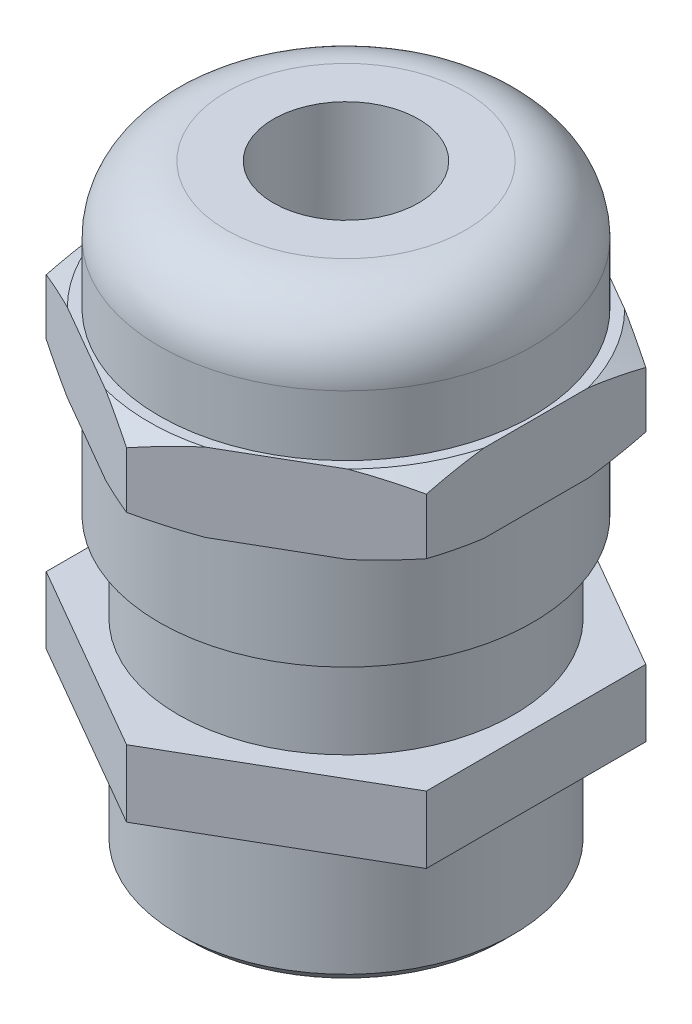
from build123d import *

# Parameters (mm, degrees)
ESTRUSIONE1_DEPTH        = 3
SCHIZZO14_R              = 7.5
ESTRUSIONE2_DEPTH        = 4
ESTRUSIONE3_START        = -4.5
SCHIZZO15_R              = 7.5
ESTRUSIONE3_DEPTH        = 4.5
SCHIZZO21_R              = 8.35
ESTRUSIONE5_DEPTH        = 4.5
ESTRUSIONE4_DEPTH        = 3.5
SCHIZZO17_W              = 8.35
SCHIZZO17_H              = 5.7
SCHIZZO18_W              = 7.5
SCHIZZO18_H              = 6
FORO4_D                  = 6.5
SMUSSO4_SIZE             = 0.5
RACCORDO4_R              = 3
SCHIZZO23_R              = 4.25
TAGLIO_ESTRUSIONE1_DEPTH = 20


with BuildPart() as part:
    # Schizzo13 → Estrusione1 (new body)
    with BuildSketch(Plane(origin=(0, 3, 0), x_dir=(-1, 0, 0), z_dir=(0, 1, 0))):
        Polygon((0, -9.814954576), (8.5, -4.907477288), (8.5, 4.907477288), (0, 9.814954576), (-8.5, 4.907477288), (-8.5, -4.907477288), align=None)
    extrude(amount=-ESTRUSIONE1_DEPTH)

    # Schizzo14 → Estrusione2 (add)
    with BuildSketch(Plane(origin=(0, 3, 0), x_dir=(-1, 0, 0), z_dir=(0, 1, 0))):
        with Locations(Location((0, 0, 0), (0, 0, 270))):
            Circle(SCHIZZO14_R)
    extrude(amount=ESTRUSIONE2_DEPTH)

    # Schizzo15 → Estrusione3 (add)
    with BuildSketch(Plane(origin=(0, 7, 0), x_dir=(-1, 0, 0), z_dir=(0, 1, 0)).offset(ESTRUSIONE3_START)):
        with Locations(Location((0, 0, 0), (0, 0, 270))):
            Circle(SCHIZZO15_R)
    extrude(amount=ESTRUSIONE3_DEPTH)

    # Schizzo21 → Estrusione5 (add)
    with BuildSketch(Plane(origin=(0, 7, 0), x_dir=(-1, 0, 0), z_dir=(0, 1, 0))):
        with Locations(Location((0, 0, 0), (0, 0, 90))):
            Circle(SCHIZZO21_R)
    extrude(amount=ESTRUSIONE5_DEPTH)

    # Schizzo16 → Estrusione4 (add)
    with BuildSketch(Plane.XZ.offset(-11.5)):
        Polygon((8.5, 4.907477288), (0, 9.814954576), (-8.5, 4.907477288), (-8.5, -4.907477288), (0, -9.814954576), (8.5, -4.907477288), align=None)
    extrude(amount=-ESTRUSIONE4_DEPTH)

    # Schizzo17 → Rivoluzione7 (revolve)
    with BuildSketch(Plane.XY, mode=Mode.PRIVATE) as rivoluzione7_sk:
        with Locations((-4.175, 17.85)):
            Rectangle(SCHIZZO17_W, SCHIZZO17_H)
    revolve(rivoluzione7_sk.sketch.rotate(Axis((0, 15, 0), (0, 1, 0)), 90), axis=Axis((0, 15, 0), (0, 1, 0)))

    # Schizzo18 → Rivoluzione8 (revolve)
    with BuildSketch(Plane.XY, mode=Mode.PRIVATE) as rivoluzione8_sk:
        with Locations((-3.75, -3)):
            Rectangle(SCHIZZO18_W, SCHIZZO18_H)
    revolve(rivoluzione8_sk.sketch.rotate(Axis((0, -6, 0), (0, 1, 0)), 90), axis=Axis((0, -6, 0), (0, 1, 0)))

    # Foro4 (through all)
    with Locations(Plane(origin=(0, 20.7, 0), x_dir=(-1, 0, 0), z_dir=(0, 1, 0))):
        with Locations((0, 0)):
            Hole(FORO4_D / 2)

    # Smusso4
    smusso4_edges = [part.edges().sort_by_distance(p)[0] for p in [
        (0, -6, -7.5),
    ]]
    chamfer(smusso4_edges, length=SMUSSO4_SIZE)

    # Raccordo4
    raccordo4_edges = [part.edges().sort_by_distance(p)[0] for p in [
        (0, 20.7, -8.35),
    ]]
    fillet(raccordo4_edges, radius=RACCORDO4_R)

    # Schizzo22 → Taglia-Rivoluzione1 (revolve, cut)
    with BuildSketch(Plane(origin=(0, 0, 0), x_dir=(0, 0, -1), z_dir=(1, 0, 0)), mode=Mode.PRIVATE) as taglia_rivoluzione1_sk:
        Polygon((-9.814954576, 15), (-9.814954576, 14.5), (-8.814954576, 15), align=None)
        Polygon((-9.814954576, 11.5), (-8.814954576, 11.5), (-9.814954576, 12), align=None)
    revolve(taglia_rivoluzione1_sk.sketch.rotate(Axis((0, 20.7, 0), (0, 1, 0)), 180), axis=Axis((0, 20.7, 0), (0, 1, 0)), mode=Mode.SUBTRACT)

    # Schizzo23 → Taglio-Estrusione1 (cut)
    with BuildSketch(Plane.XZ.offset(6)):
        with Locations(Location((0, 0, 0), (0, 0, 270))):
            Circle(SCHIZZO23_R)
    extrude(amount=-TAGLIO_ESTRUSIONE1_DEPTH, mode=Mode.SUBTRACT)


solid = part.part
